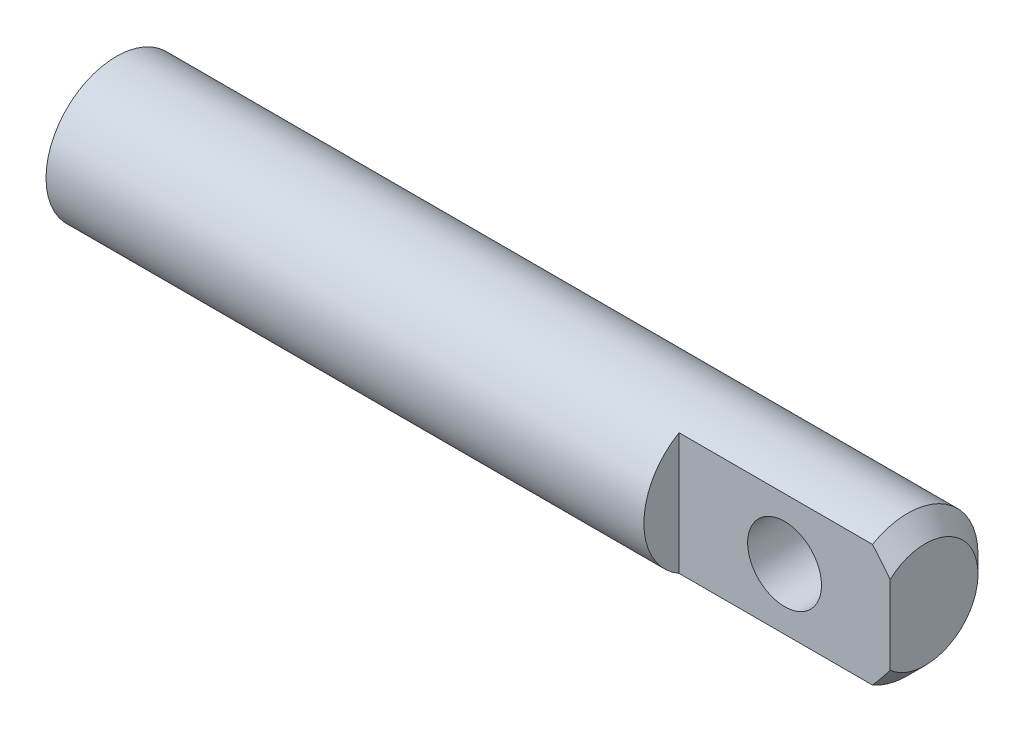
from build123d import *

# Parameters (mm, degrees)
CUT_EXTRUDE3_DEPTH = 6
SKETCH5_R          = 1.05
CUT_EXTRUDE4_DEPTH = 24.280893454


with BuildPart() as part:
    # Sketch1 → Revolve1 (revolve)
    with BuildSketch(Plane.XY, mode=Mode.PRIVATE) as revolve1_sk:
        Polygon((0, 0), (0, 2), (22.5, 2), (23, 1.5), (23, 0), align=None)
    revolve(revolve1_sk.sketch.rotate(Axis((0, 0, 0), (1, 0, 0)), 90), axis=Axis((0, 0, 0), (1, 0, 0)))

    # Sketch4 → Cut-Extrude3 (cut)
    with BuildSketch(Plane(origin=(23, 0, 0), x_dir=(0, 0, -1), z_dir=(1, 0, 0))):
        with BuildLine():
            Line((-1, 1.732050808), (-1, -1.732050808))
            ThreePointArc((-1, -1.732050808), (-2, 0), (-1, 1.732050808))
        make_face()
    extrude(amount=-CUT_EXTRUDE3_DEPTH, mode=Mode.SUBTRACT)

    # Sketch5 → Cut-Extrude4 (cut, through all)
    with BuildSketch(Plane.XY.offset(1)):
        with Locations((20, 0)):
            Circle(SKETCH5_R)
    extrude(amount=-CUT_EXTRUDE4_DEPTH, mode=Mode.SUBTRACT)


solid = part.part
